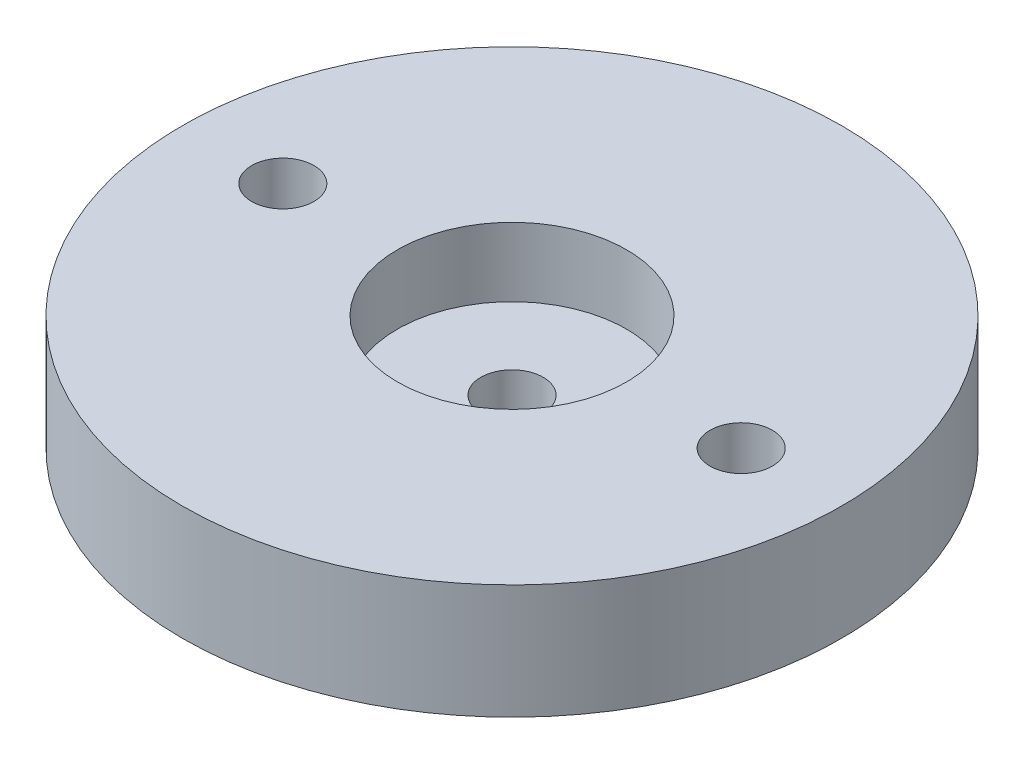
ISO-10303-21;
HEADER;
FILE_DESCRIPTION(('STEP AP214'),'2;1');
FILE_NAME('part.step','',(''),(''),'','','');
FILE_SCHEMA(('AUTOMOTIVE_DESIGN { 1 0 10303 214 1 1 1 1 }'));
ENDSEC;
DATA;
#1=APPLICATION_CONTEXT('core data for automotive mechanical design processes');
#2=APPLICATION_PROTOCOL_DEFINITION('international standard','automotive_design',2000,#1);
#3=PRODUCT_CONTEXT('',#1,'mechanical');
#4=PRODUCT('Part','Part','',(#3));
#5=PRODUCT_RELATED_PRODUCT_CATEGORY('part','',(#4));
#6=PRODUCT_DEFINITION_FORMATION('','',#4);
#7=PRODUCT_DEFINITION_CONTEXT('part definition',#1,'design');
#8=PRODUCT_DEFINITION('design','',#6,#7);
#9=PRODUCT_DEFINITION_SHAPE('','',#8);
#10=(LENGTH_UNIT() NAMED_UNIT(*) SI_UNIT(.MILLI.,.METRE.));
#11=(NAMED_UNIT(*) PLANE_ANGLE_UNIT() SI_UNIT($,.RADIAN.));
#12=(NAMED_UNIT(*) SI_UNIT($,.STERADIAN.) SOLID_ANGLE_UNIT());
#13=UNCERTAINTY_MEASURE_WITH_UNIT(LENGTH_MEASURE(1.E-05),#10,'distance_accuracy_value','');
#14=(GEOMETRIC_REPRESENTATION_CONTEXT(3) GLOBAL_UNCERTAINTY_ASSIGNED_CONTEXT((#13)) GLOBAL_UNIT_ASSIGNED_CONTEXT((#10,
#11,#12)) REPRESENTATION_CONTEXT('',''));
#15=CARTESIAN_POINT('',(0.,0.,0.));
#16=DIRECTION('',(0.,0.,1.));
#17=DIRECTION('',(1.,0.,0.));
#18=AXIS2_PLACEMENT_3D('',#15,#16,#17);
#19=CARTESIAN_POINT('',(0.,6.35,0.));
#20=DIRECTION('',(0.,-1.,0.));
#21=DIRECTION('',(0.,0.,-1.));
#22=AXIS2_PLACEMENT_3D('',#19,#20,#21);
#23=CYLINDRICAL_SURFACE('',#22,1.7272);
#24=CARTESIAN_POINT('',(0.,0.,0.));
#25=DIRECTION('',(0.,1.,0.));
#26=DIRECTION('',(0.,0.,1.));
#27=AXIS2_PLACEMENT_3D('',#24,#25,#26);
#28=CIRCLE('',#27,1.7272);
#29=CARTESIAN_POINT('',(0.,0.,1.7272));
#30=VERTEX_POINT('',#29);
#31=EDGE_CURVE('E47',#30,#30,#28,.T.);
#32=ORIENTED_EDGE('',*,*,#31,.F.);
#33=EDGE_LOOP('',(#32));
#34=FACE_BOUND('',#33,.T.);
#35=CARTESIAN_POINT('',(0.,2.54,0.));
#36=DIRECTION('',(0.,1.,0.));
#37=DIRECTION('',(0.,0.,1.));
#38=AXIS2_PLACEMENT_3D('',#35,#36,#37);
#39=CIRCLE('',#38,1.7272);
#40=CARTESIAN_POINT('',(0.,2.54,1.7272));
#41=VERTEX_POINT('',#40);
#42=EDGE_CURVE('E38',#41,#41,#39,.T.);
#43=ORIENTED_EDGE('',*,*,#42,.T.);
#44=EDGE_LOOP('',(#43));
#45=FACE_BOUND('',#44,.T.);
#46=ADVANCED_FACE('F34',(#34,#45),#23,.F.);
#47=CARTESIAN_POINT('',(0.,6.35,0.));
#48=DIRECTION('',(0.,1.,0.));
#49=DIRECTION('',(0.,0.,1.));
#50=AXIS2_PLACEMENT_3D('',#47,#48,#49);
#51=PLANE('',#50);
#52=CARTESIAN_POINT('',(-12.7,6.35,0.));
#53=DIRECTION('',(0.,1.,0.));
#54=DIRECTION('',(0.,0.,1.));
#55=AXIS2_PLACEMENT_3D('',#52,#53,#54);
#56=CIRCLE('',#55,1.7272);
#57=CARTESIAN_POINT('',(-12.7,6.35,1.7272));
#58=VERTEX_POINT('',#57);
#59=EDGE_CURVE('E55',#58,#58,#56,.T.);
#60=ORIENTED_EDGE('',*,*,#59,.F.);
#61=EDGE_LOOP('',(#60));
#62=FACE_BOUND('',#61,.T.);
#63=CARTESIAN_POINT('',(12.7,6.35,0.));
#64=DIRECTION('',(0.,1.,0.));
#65=DIRECTION('',(0.,0.,1.));
#66=AXIS2_PLACEMENT_3D('',#63,#64,#65);
#67=CIRCLE('',#66,1.7272);
#68=CARTESIAN_POINT('',(12.7,6.35,1.7272));
#69=VERTEX_POINT('',#68);
#70=EDGE_CURVE('E61',#69,#69,#67,.T.);
#71=ORIENTED_EDGE('',*,*,#70,.F.);
#72=EDGE_LOOP('',(#71));
#73=FACE_BOUND('',#72,.T.);
#74=CARTESIAN_POINT('',(0.,6.35,0.));
#75=DIRECTION('',(0.,1.,0.));
#76=DIRECTION('',(0.,0.,1.));
#77=AXIS2_PLACEMENT_3D('',#74,#75,#76);
#78=CIRCLE('',#77,6.35);
#79=CARTESIAN_POINT('',(0.,6.35,6.35));
#80=VERTEX_POINT('',#79);
#81=EDGE_CURVE('E51',#80,#80,#78,.T.);
#82=ORIENTED_EDGE('',*,*,#81,.F.);
#83=EDGE_LOOP('',(#82));
#84=FACE_BOUND('',#83,.T.);
#85=CARTESIAN_POINT('',(0.,6.35,0.));
#86=DIRECTION('',(0.,1.,0.));
#87=DIRECTION('',(0.,0.,1.));
#88=AXIS2_PLACEMENT_3D('',#85,#86,#87);
#89=CIRCLE('',#88,18.2626);
#90=CARTESIAN_POINT('',(0.,6.35,18.2626));
#91=VERTEX_POINT('',#90);
#92=EDGE_CURVE('E10',#91,#91,#89,.T.);
#93=ORIENTED_EDGE('',*,*,#92,.T.);
#94=EDGE_LOOP('',(#93));
#95=FACE_BOUND('',#94,.T.);
#96=ADVANCED_FACE('F73',(#62,#73,#84,#95),#51,.T.);
#97=CARTESIAN_POINT('',(0.,0.,0.));
#98=DIRECTION('',(0.,1.,0.));
#99=DIRECTION('',(0.,0.,1.));
#100=AXIS2_PLACEMENT_3D('',#97,#98,#99);
#101=PLANE('',#100);
#102=CARTESIAN_POINT('',(-12.7,0.,0.));
#103=DIRECTION('',(0.,1.,0.));
#104=DIRECTION('',(0.,0.,1.));
#105=AXIS2_PLACEMENT_3D('',#102,#103,#104);
#106=CIRCLE('',#105,1.7272);
#107=CARTESIAN_POINT('',(-12.7,0.,1.7272));
#108=VERTEX_POINT('',#107);
#109=EDGE_CURVE('E64',#108,#108,#106,.T.);
#110=ORIENTED_EDGE('',*,*,#109,.T.);
#111=EDGE_LOOP('',(#110));
#112=FACE_BOUND('',#111,.T.);
#113=CARTESIAN_POINT('',(12.7,0.,0.));
#114=DIRECTION('',(0.,1.,0.));
#115=DIRECTION('',(0.,0.,1.));
#116=AXIS2_PLACEMENT_3D('',#113,#114,#115);
#117=CIRCLE('',#116,1.7272);
#118=CARTESIAN_POINT('',(12.7,0.,1.7272));
#119=VERTEX_POINT('',#118);
#120=EDGE_CURVE('E58',#119,#119,#117,.T.);
#121=ORIENTED_EDGE('',*,*,#120,.T.);
#122=EDGE_LOOP('',(#121));
#123=FACE_BOUND('',#122,.T.);
#124=CARTESIAN_POINT('',(0.,0.,0.));
#125=DIRECTION('',(0.,1.,0.));
#126=DIRECTION('',(0.,0.,1.));
#127=AXIS2_PLACEMENT_3D('',#124,#125,#126);
#128=CIRCLE('',#127,18.2626);
#129=CARTESIAN_POINT('',(0.,0.,18.2626));
#130=VERTEX_POINT('',#129);
#131=EDGE_CURVE('E42',#130,#130,#128,.T.);
#132=ORIENTED_EDGE('',*,*,#131,.F.);
#133=EDGE_LOOP('',(#132));
#134=FACE_BOUND('',#133,.T.);
#135=ORIENTED_EDGE('',*,*,#31,.T.);
#136=EDGE_LOOP('',(#135));
#137=FACE_BOUND('',#136,.T.);
#138=ADVANCED_FACE('F76',(#112,#123,#134,#137),#101,.F.);
#139=CARTESIAN_POINT('',(0.,6.35,0.));
#140=DIRECTION('',(0.,-1.,0.));
#141=DIRECTION('',(0.,0.,-1.));
#142=AXIS2_PLACEMENT_3D('',#139,#140,#141);
#143=CYLINDRICAL_SURFACE('',#142,18.2626);
#144=ORIENTED_EDGE('',*,*,#92,.F.);
#145=EDGE_LOOP('',(#144));
#146=FACE_BOUND('',#145,.T.);
#147=ORIENTED_EDGE('',*,*,#131,.T.);
#148=EDGE_LOOP('',(#147));
#149=FACE_BOUND('',#148,.T.);
#150=ADVANCED_FACE('F36',(#146,#149),#143,.T.);
#151=CARTESIAN_POINT('',(0.,2.54,0.));
#152=DIRECTION('',(0.,1.,0.));
#153=DIRECTION('',(0.,0.,1.));
#154=AXIS2_PLACEMENT_3D('',#151,#152,#153);
#155=CYLINDRICAL_SURFACE('',#154,6.35);
#156=CARTESIAN_POINT('',(0.,2.54,0.));
#157=DIRECTION('',(0.,1.,0.));
#158=DIRECTION('',(0.,0.,1.));
#159=AXIS2_PLACEMENT_3D('',#156,#157,#158);
#160=CIRCLE('',#159,6.35);
#161=CARTESIAN_POINT('',(0.,2.54,6.35));
#162=VERTEX_POINT('',#161);
#163=EDGE_CURVE('E54',#162,#162,#160,.T.);
#164=CARTESIAN_POINT('',(0.,2.54,6.35));
#165=CARTESIAN_POINT('',(0.,2.5796875,6.35));
#166=CARTESIAN_POINT('',(0.,2.619375,6.35));
#167=CARTESIAN_POINT('',(0.,2.69875,6.35));
#168=CARTESIAN_POINT('',(0.,2.7384375,6.35));
#169=CARTESIAN_POINT('',(0.,2.8178125,6.35));
#170=CARTESIAN_POINT('',(0.,2.8575,6.35));
#171=CARTESIAN_POINT('',(0.,2.936875,6.35));
#172=CARTESIAN_POINT('',(0.,2.9765625,6.35));
#173=CARTESIAN_POINT('',(0.,3.0559375,6.35));
#174=CARTESIAN_POINT('',(0.,3.095625,6.35));
#175=CARTESIAN_POINT('',(0.,3.175,6.35));
#176=CARTESIAN_POINT('',(0.,3.2146875,6.35));
#177=CARTESIAN_POINT('',(0.,3.2940625,6.35));
#178=CARTESIAN_POINT('',(0.,3.33375,6.35));
#179=CARTESIAN_POINT('',(0.,3.413125,6.35));
#180=CARTESIAN_POINT('',(0.,3.4528125,6.35));
#181=CARTESIAN_POINT('',(0.,3.5321875,6.35));
#182=CARTESIAN_POINT('',(0.,3.571875,6.35));
#183=CARTESIAN_POINT('',(0.,3.65125,6.35));
#184=CARTESIAN_POINT('',(0.,3.6909375,6.35));
#185=CARTESIAN_POINT('',(0.,3.7703125,6.35));
#186=CARTESIAN_POINT('',(0.,3.81,6.35));
#187=CARTESIAN_POINT('',(0.,3.889375,6.35));
#188=CARTESIAN_POINT('',(0.,3.9290625,6.35));
#189=CARTESIAN_POINT('',(0.,4.0084375,6.35));
#190=CARTESIAN_POINT('',(0.,4.048125,6.35));
#191=CARTESIAN_POINT('',(0.,4.1275,6.35));
#192=CARTESIAN_POINT('',(0.,4.1671875,6.35));
#193=CARTESIAN_POINT('',(0.,4.2465625,6.35));
#194=CARTESIAN_POINT('',(0.,4.28625,6.35));
#195=CARTESIAN_POINT('',(0.,4.365625,6.35));
#196=CARTESIAN_POINT('',(0.,4.4053125,6.35));
#197=CARTESIAN_POINT('',(0.,4.4846875,6.35));
#198=CARTESIAN_POINT('',(0.,4.524375,6.35));
#199=CARTESIAN_POINT('',(0.,4.60375,6.35));
#200=CARTESIAN_POINT('',(0.,4.6434375,6.35));
#201=CARTESIAN_POINT('',(0.,4.7228125,6.35));
#202=CARTESIAN_POINT('',(0.,4.7625,6.35));
#203=CARTESIAN_POINT('',(0.,4.841875,6.35));
#204=CARTESIAN_POINT('',(0.,4.8815625,6.35));
#205=CARTESIAN_POINT('',(0.,4.9609375,6.35));
#206=CARTESIAN_POINT('',(0.,5.000625,6.35));
#207=CARTESIAN_POINT('',(0.,5.08,6.35));
#208=CARTESIAN_POINT('',(0.,5.1196875,6.35));
#209=CARTESIAN_POINT('',(0.,5.1990625,6.35));
#210=CARTESIAN_POINT('',(0.,5.23875,6.35));
#211=CARTESIAN_POINT('',(0.,5.318125,6.35));
#212=CARTESIAN_POINT('',(0.,5.3578125,6.35));
#213=CARTESIAN_POINT('',(0.,5.4371875,6.35));
#214=CARTESIAN_POINT('',(0.,5.476875,6.35));
#215=CARTESIAN_POINT('',(0.,5.55625,6.35));
#216=CARTESIAN_POINT('',(0.,5.5959375,6.35));
#217=CARTESIAN_POINT('',(0.,5.6753125,6.35));
#218=CARTESIAN_POINT('',(0.,5.715,6.35));
#219=CARTESIAN_POINT('',(0.,5.794375,6.35));
#220=CARTESIAN_POINT('',(0.,5.8340625,6.35));
#221=CARTESIAN_POINT('',(0.,5.9134375,6.35));
#222=CARTESIAN_POINT('',(0.,5.953125,6.35));
#223=CARTESIAN_POINT('',(0.,6.0325,6.35));
#224=CARTESIAN_POINT('',(0.,6.0721875,6.35));
#225=CARTESIAN_POINT('',(0.,6.1515625,6.35));
#226=CARTESIAN_POINT('',(0.,6.19125,6.35));
#227=CARTESIAN_POINT('',(0.,6.270625,6.35));
#228=CARTESIAN_POINT('',(0.,6.3103125,6.35));
#229=CARTESIAN_POINT('',(0.,6.35,6.35));
#230=B_SPLINE_CURVE_WITH_KNOTS('',3,(#164,#165,#166,#167,#168,#169,#170,#171,#172,#173,#174,
#175,#176,#177,#178,#179,#180,#181,#182,#183,#184,#185,#186,#187,#188,#189,#190,#191,#192,#193,
#194,#195,#196,#197,#198,#199,#200,#201,#202,#203,#204,#205,#206,#207,#208,#209,#210,#211,#212,
#213,#214,#215,#216,#217,#218,#219,#220,#221,#222,#223,#224,#225,#226,#227,#228,#229),
.UNSPECIFIED.,.F.,.F.,(4,2,2,2,2,2,2,2,2,2,2,2,2,2,2,2,2,2,2,2,2,2,2,2,2,2,2,2,2,2,2,2,4),(0.,
0.1190625,0.238125,0.3571875,0.47625,0.5953125,0.714375,0.8334375,0.9525,1.0715625,1.190625,
1.3096875,1.42875,1.5478125,1.666875,1.7859375,1.905,2.0240625,2.143125,2.2621875,2.38125,
2.5003125,2.619375,2.7384375,2.8575,2.9765625,3.095625,3.2146875,3.33375,3.4528125,3.571875,
3.6909375,3.81),.UNSPECIFIED.);
#231=EDGE_CURVE('BSEAM82',#162,#80,#230,.T.);
#232=ORIENTED_EDGE('',*,*,#163,.F.);
#233=ORIENTED_EDGE('',*,*,#81,.T.);
#234=ORIENTED_EDGE('',*,*,#231,.T.);
#235=ORIENTED_EDGE('',*,*,#231,.F.);
#236=EDGE_LOOP('',(#232,#234,#233,#235));
#237=FACE_BOUND('',#236,.T.);
#238=ADVANCED_FACE('F82',(#237),#155,.F.);
#239=CARTESIAN_POINT('',(0.,2.54,0.));
#240=DIRECTION('',(0.,1.,0.));
#241=DIRECTION('',(0.,0.,1.));
#242=AXIS2_PLACEMENT_3D('',#239,#240,#241);
#243=PLANE('',#242);
#244=ORIENTED_EDGE('',*,*,#42,.F.);
#245=EDGE_LOOP('',(#244));
#246=FACE_BOUND('',#245,.T.);
#247=ORIENTED_EDGE('',*,*,#163,.T.);
#248=EDGE_LOOP('',(#247));
#249=FACE_BOUND('',#248,.T.);
#250=ADVANCED_FACE('F84',(#246,#249),#243,.T.);
#251=CARTESIAN_POINT('',(12.7,6.35,0.));
#252=DIRECTION('',(0.,-1.,0.));
#253=DIRECTION('',(0.,0.,-1.));
#254=AXIS2_PLACEMENT_3D('',#251,#252,#253);
#255=CYLINDRICAL_SURFACE('',#254,1.7272);
#256=ORIENTED_EDGE('',*,*,#70,.T.);
#257=EDGE_LOOP('',(#256));
#258=FACE_BOUND('',#257,.T.);
#259=ORIENTED_EDGE('',*,*,#120,.F.);
#260=EDGE_LOOP('',(#259));
#261=FACE_BOUND('',#260,.T.);
#262=ADVANCED_FACE('F91',(#258,#261),#255,.F.);
#263=CARTESIAN_POINT('',(-12.7,6.35,0.));
#264=DIRECTION('',(0.,-1.,0.));
#265=DIRECTION('',(0.,0.,-1.));
#266=AXIS2_PLACEMENT_3D('',#263,#264,#265);
#267=CYLINDRICAL_SURFACE('',#266,1.7272);
#268=ORIENTED_EDGE('',*,*,#59,.T.);
#269=EDGE_LOOP('',(#268));
#270=FACE_BOUND('',#269,.T.);
#271=ORIENTED_EDGE('',*,*,#109,.F.);
#272=EDGE_LOOP('',(#271));
#273=FACE_BOUND('',#272,.T.);
#274=ADVANCED_FACE('F70',(#270,#273),#267,.F.);
#275=CLOSED_SHELL('',(#46,#96,#138,#150,#238,#250,#262,#274));
#276=MANIFOLD_SOLID_BREP('B2',#275);
#277=ADVANCED_BREP_SHAPE_REPRESENTATION('',(#18,#276),#14);
#278=SHAPE_DEFINITION_REPRESENTATION(#9,#277);
ENDSEC;
END-ISO-10303-21;
